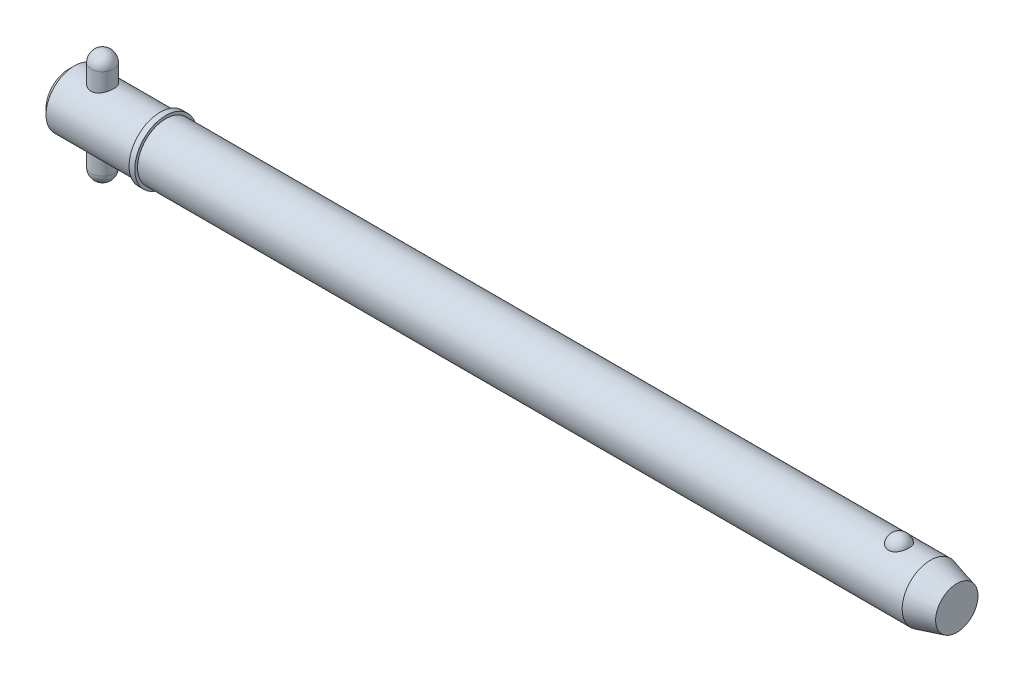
ISO-10303-21;
HEADER;
FILE_DESCRIPTION(('STEP AP214'),'2;1');
FILE_NAME('part.step','',(''),(''),'','','');
FILE_SCHEMA(('AUTOMOTIVE_DESIGN { 1 0 10303 214 1 1 1 1 }'));
ENDSEC;
DATA;
#1=APPLICATION_CONTEXT('core data for automotive mechanical design processes');
#2=APPLICATION_PROTOCOL_DEFINITION('international standard','automotive_design',2000,#1);
#3=PRODUCT_CONTEXT('',#1,'mechanical');
#4=PRODUCT('Part','Part','',(#3));
#5=PRODUCT_RELATED_PRODUCT_CATEGORY('part','',(#4));
#6=PRODUCT_DEFINITION_FORMATION('','',#4);
#7=PRODUCT_DEFINITION_CONTEXT('part definition',#1,'design');
#8=PRODUCT_DEFINITION('design','',#6,#7);
#9=PRODUCT_DEFINITION_SHAPE('','',#8);
#10=(LENGTH_UNIT() NAMED_UNIT(*) SI_UNIT(.MILLI.,.METRE.));
#11=(NAMED_UNIT(*) PLANE_ANGLE_UNIT() SI_UNIT($,.RADIAN.));
#12=(NAMED_UNIT(*) SI_UNIT($,.STERADIAN.) SOLID_ANGLE_UNIT());
#13=UNCERTAINTY_MEASURE_WITH_UNIT(LENGTH_MEASURE(1.E-05),#10,'distance_accuracy_value','');
#14=(GEOMETRIC_REPRESENTATION_CONTEXT(3) GLOBAL_UNCERTAINTY_ASSIGNED_CONTEXT((#13)) GLOBAL_UNIT_ASSIGNED_CONTEXT((#10,
#11,#12)) REPRESENTATION_CONTEXT('',''));
#15=CARTESIAN_POINT('',(0.,0.,0.));
#16=DIRECTION('',(0.,0.,1.));
#17=DIRECTION('',(1.,0.,0.));
#18=AXIS2_PLACEMENT_3D('',#15,#16,#17);
#19=CARTESIAN_POINT('',(9.525,15.875,0.));
#20=DIRECTION('',(0.,-1.,0.));
#21=DIRECTION('',(0.,0.,-1.));
#22=AXIS2_PLACEMENT_3D('',#19,#20,#21);
#23=CYLINDRICAL_SURFACE('',#22,3.175);
#24=CARTESIAN_POINT('',(9.525,-12.7,0.));
#25=DIRECTION('',(0.,-1.,0.));
#26=DIRECTION('',(0.,0.,-1.));
#27=AXIS2_PLACEMENT_3D('',#24,#25,#26);
#28=CIRCLE('',#27,3.175);
#29=CARTESIAN_POINT('',(9.525,-12.7,-3.175));
#30=VERTEX_POINT('',#29);
#31=EDGE_CURVE('P0_E10',#30,#30,#28,.F.);
#32=ORIENTED_EDGE('',*,*,#31,.T.);
#33=EDGE_LOOP('',(#32));
#34=FACE_BOUND('',#33,.T.);
#35=CARTESIAN_POINT('',(9.525,12.7,0.));
#36=DIRECTION('',(0.,-1.,0.));
#37=DIRECTION('',(0.,0.,-1.));
#38=AXIS2_PLACEMENT_3D('',#35,#36,#37);
#39=CIRCLE('',#38,3.175);
#40=CARTESIAN_POINT('',(9.525,12.7,-3.175));
#41=VERTEX_POINT('',#40);
#42=EDGE_CURVE('P0_E21',#41,#41,#39,.T.);
#43=ORIENTED_EDGE('',*,*,#42,.T.);
#44=EDGE_LOOP('',(#43));
#45=FACE_BOUND('',#44,.T.);
#46=ADVANCED_FACE('P0_F14',(#34,#45),#23,.T.);
#47=CARTESIAN_POINT('',(9.525,-12.7,0.));
#48=DIRECTION('',(0.,0.,1.));
#49=DIRECTION('',(1.,0.,0.));
#50=AXIS2_PLACEMENT_3D('',#47,#48,#49);
#51=SPHERICAL_SURFACE('',#50,3.175);
#52=CARTESIAN_POINT('',(9.525,-12.7,0.));
#53=DIRECTION('',(0.,-1.,0.));
#54=DIRECTION('',(0.,0.,-1.));
#55=AXIS2_PLACEMENT_3D('',#52,#53,#54);
#56=SPHERICAL_SURFACE('',#55,3.175);
#57=ORIENTED_EDGE('',*,*,#31,.F.);
#58=EDGE_LOOP('',(#57));
#59=FACE_BOUND('',#58,.T.);
#60=ADVANCED_FACE('P0_F29',(#59),#56,.T.);
#61=CARTESIAN_POINT('',(9.525,12.7,0.));
#62=DIRECTION('',(0.,0.,1.));
#63=DIRECTION('',(1.,0.,0.));
#64=AXIS2_PLACEMENT_3D('',#61,#62,#63);
#65=SPHERICAL_SURFACE('',#64,3.175);
#66=CARTESIAN_POINT('',(9.525,12.7,0.));
#67=DIRECTION('',(0.,-1.,0.));
#68=DIRECTION('',(0.,0.,-1.));
#69=AXIS2_PLACEMENT_3D('',#66,#67,#68);
#70=SPHERICAL_SURFACE('',#69,3.175);
#71=ORIENTED_EDGE('',*,*,#42,.F.);
#72=EDGE_LOOP('',(#71));
#73=FACE_BOUND('',#72,.T.);
#74=ADVANCED_FACE('P0_F16',(#73),#70,.T.);
#75=CLOSED_SHELL('',(#46,#60,#74));
#76=MANIFOLD_SOLID_BREP('P0_B1',#75);
#77=CARTESIAN_POINT('',(0.,0.,0.));
#78=DIRECTION('',(1.,0.,0.));
#79=DIRECTION('',(0.,0.,-1.));
#80=AXIS2_PLACEMENT_3D('',#77,#78,#79);
#81=CYLINDRICAL_SURFACE('',#80,7.94);
#82=CARTESIAN_POINT('',(242.151879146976,0.,0.));
#83=DIRECTION('',(1.,0.,0.));
#84=DIRECTION('',(0.,0.,-1.));
#85=AXIS2_PLACEMENT_3D('',#82,#83,#84);
#86=CIRCLE('',#85,7.94);
#87=CARTESIAN_POINT('',(242.151879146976,0.,-7.94));
#88=VERTEX_POINT('',#87);
#89=EDGE_CURVE('P1_E81',#88,#88,#86,.T.);
#90=ORIENTED_EDGE('',*,*,#89,.F.);
#91=EDGE_LOOP('',(#90));
#92=FACE_BOUND('',#91,.T.);
#93=CARTESIAN_POINT('',(27.31,0.,0.));
#94=DIRECTION('',(1.,0.,0.));
#95=DIRECTION('',(0.,0.,-1.));
#96=AXIS2_PLACEMENT_3D('',#93,#94,#95);
#97=CIRCLE('',#96,7.94);
#98=CARTESIAN_POINT('',(27.31,0.,-7.94));
#99=VERTEX_POINT('',#98);
#100=EDGE_CURVE('P1_E85',#99,#99,#97,.T.);
#101=ORIENTED_EDGE('',*,*,#100,.T.);
#102=EDGE_LOOP('',(#101));
#103=FACE_BOUND('',#102,.T.);
#104=CARTESIAN_POINT('',(233.344907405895,7.37767842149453,2.93486986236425));
#105=CARTESIAN_POINT('',(233.192749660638,7.37767329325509,2.93487505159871));
#106=CARTESIAN_POINT('',(233.040632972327,7.38258419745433,2.92262454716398));
#107=CARTESIAN_POINT('',(232.740928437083,7.40163229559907,2.87404196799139));
#108=CARTESIAN_POINT('',(232.593339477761,7.41576720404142,2.83771585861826));
#109=CARTESIAN_POINT('',(232.307018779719,7.45161576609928,2.74218769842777));
#110=CARTESIAN_POINT('',(232.168274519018,7.47331841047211,2.68301886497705));
#111=CARTESIAN_POINT('',(231.902882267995,7.52194082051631,2.54350967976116));
#112=CARTESIAN_POINT('',(231.776236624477,7.54886159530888,2.463165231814));
#113=CARTESIAN_POINT('',(231.534534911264,7.60594671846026,2.28090375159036));
#114=CARTESIAN_POINT('',(231.419906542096,7.63618114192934,2.17844211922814));
#115=CARTESIAN_POINT('',(231.208878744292,7.6961404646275,1.956084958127));
#116=CARTESIAN_POINT('',(231.112482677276,7.72586526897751,1.8361862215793));
#117=CARTESIAN_POINT('',(230.935938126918,7.78314821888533,1.5762808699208));
#118=CARTESIAN_POINT('',(230.856707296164,7.81055035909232,1.43561546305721));
#119=CARTESIAN_POINT('',(230.721797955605,7.85879631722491,1.14236334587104));
#120=CARTESIAN_POINT('',(230.666121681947,7.87963951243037,0.989775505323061));
#121=CARTESIAN_POINT('',(230.57881215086,7.91289645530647,0.674619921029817));
#122=CARTESIAN_POINT('',(230.54753090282,7.92518652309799,0.511941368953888));
#123=CARTESIAN_POINT('',(230.510975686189,7.93958930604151,0.183247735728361));
#124=CARTESIAN_POINT('',(230.505701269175,7.94170219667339,0.0172327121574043));
#125=CARTESIAN_POINT('',(230.521231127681,7.93554931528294,-0.312672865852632));
#126=CARTESIAN_POINT('',(230.541925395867,7.92732732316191,-0.476569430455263));
#127=CARTESIAN_POINT('',(230.60878655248,7.90141534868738,-0.7983052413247));
#128=CARTESIAN_POINT('',(230.654953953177,7.88372517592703,-0.956144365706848));
#129=CARTESIAN_POINT('',(230.771898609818,7.84066230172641,-1.26152073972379));
#130=CARTESIAN_POINT('',(230.842704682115,7.81528060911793,-1.40904568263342));
#131=CARTESIAN_POINT('',(231.007478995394,7.75948672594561,-1.68950598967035));
#132=CARTESIAN_POINT('',(231.101448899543,7.72907417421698,-1.82244030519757));
#133=CARTESIAN_POINT('',(231.310839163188,7.66640424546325,-2.07032792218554));
#134=CARTESIAN_POINT('',(231.426315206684,7.63414223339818,-2.1852330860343));
#135=CARTESIAN_POINT('',(231.6759006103,7.57149681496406,-2.39329737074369));
#136=CARTESIAN_POINT('',(231.810008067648,7.54111321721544,-2.48645870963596));
#137=CARTESIAN_POINT('',(232.090111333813,7.48650742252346,-2.64628132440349));
#138=CARTESIAN_POINT('',(232.235760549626,7.46215900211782,-2.71350554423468));
#139=CARTESIAN_POINT('',(232.537425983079,7.42171253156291,-2.82226614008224));
#140=CARTESIAN_POINT('',(232.693438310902,7.40561140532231,-2.86381209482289));
#141=CARTESIAN_POINT('',(233.002970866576,7.38426796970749,-2.91839077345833));
#142=CARTESIAN_POINT('',(233.156222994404,7.37852109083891,-2.93275024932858));
#143=CARTESIAN_POINT('',(233.463070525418,7.37700973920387,-2.93655208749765));
#144=CARTESIAN_POINT('',(233.616665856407,7.38124333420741,-2.925999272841));
#145=CARTESIAN_POINT('',(233.914990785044,7.39890635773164,-2.88102897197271));
#146=CARTESIAN_POINT('',(234.059848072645,7.41205491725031,-2.84733999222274));
#147=CARTESIAN_POINT('',(234.34164329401,7.44580110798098,-2.75788206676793));
#148=CARTESIAN_POINT('',(234.478580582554,7.46639934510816,-2.70211132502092));
#149=CARTESIAN_POINT('',(234.744061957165,7.51339098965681,-2.56858908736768));
#150=CARTESIAN_POINT('',(234.872354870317,7.5399020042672,-2.49038067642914));
#151=CARTESIAN_POINT('',(235.114244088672,7.59569503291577,-2.31462737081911));
#152=CARTESIAN_POINT('',(235.227837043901,7.62497767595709,-2.21707808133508));
#153=CARTESIAN_POINT('',(235.44322156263,7.68489473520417,-1.99982049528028));
#154=CARTESIAN_POINT('',(235.544148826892,7.7155241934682,-1.8792533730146));
#155=CARTESIAN_POINT('',(235.725186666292,7.77353016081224,-1.62268826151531));
#156=CARTESIAN_POINT('',(235.805293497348,7.80090608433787,-1.48668750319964));
#157=CARTESIAN_POINT('',(235.945361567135,7.85047992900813,-1.19818413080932));
#158=CARTESIAN_POINT('',(236.004587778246,7.87248183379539,-1.04529016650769));
#159=CARTESIAN_POINT('',(236.097982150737,7.90785114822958,-0.731080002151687));
#160=CARTESIAN_POINT('',(236.132149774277,7.92121837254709,-0.569763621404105));
#161=CARTESIAN_POINT('',(236.174795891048,7.93797834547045,-0.242812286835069));
#162=CARTESIAN_POINT('',(236.183204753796,7.94134405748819,-0.0771668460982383));
#163=CARTESIAN_POINT('',(236.173962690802,7.93767937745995,0.253276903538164));
#164=CARTESIAN_POINT('',(236.156312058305,7.93064910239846,0.418075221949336));
#165=CARTESIAN_POINT('',(236.095424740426,7.90695571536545,0.741525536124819));
#166=CARTESIAN_POINT('',(236.052281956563,7.8903279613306,0.900197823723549));
#167=CARTESIAN_POINT('',(235.94135358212,7.84916386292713,1.20759654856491));
#168=CARTESIAN_POINT('',(235.87356656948,7.82462706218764,1.35632241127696));
#169=CARTESIAN_POINT('',(235.714371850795,7.77006699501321,1.64032869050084));
#170=CARTESIAN_POINT('',(235.622861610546,7.74002008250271,1.7755471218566));
#171=CARTESIAN_POINT('',(235.418296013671,7.67774175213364,2.0280064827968));
#172=CARTESIAN_POINT('',(235.305241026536,7.64551037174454,2.14524772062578));
#173=CARTESIAN_POINT('',(235.060831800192,7.58265895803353,2.35778002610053));
#174=CARTESIAN_POINT('',(234.929583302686,7.5520309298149,2.45319004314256));
#175=CARTESIAN_POINT('',(234.651601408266,7.49579792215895,2.61999897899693));
#176=CARTESIAN_POINT('',(234.504867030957,7.47019326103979,2.69139637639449));
#177=CARTESIAN_POINT('',(234.192947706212,7.42622216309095,2.81053241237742));
#178=CARTESIAN_POINT('',(234.027220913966,7.40825002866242,2.85700910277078));
#179=CARTESIAN_POINT('',(233.689279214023,7.38398348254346,2.91916850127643));
#180=CARTESIAN_POINT('',(233.51706702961,7.37768422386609,2.93486399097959));
#181=CARTESIAN_POINT('',(233.344907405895,7.37767842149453,2.93486986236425));
#182=B_SPLINE_CURVE_WITH_KNOTS('',3,(#104,#105,#106,#107,#108,#109,#110,#111,#112,#113,#114,
#115,#116,#117,#118,#119,#120,#121,#122,#123,#124,#125,#126,#127,#128,#129,#130,#131,#132,#133,
#134,#135,#136,#137,#138,#139,#140,#141,#142,#143,#144,#145,#146,#147,#148,#149,#150,#151,#152,
#153,#154,#155,#156,#157,#158,#159,#160,#161,#162,#163,#164,#165,#166,#167,#168,#169,#170,#171,
#172,#173,#174,#175,#176,#177,#178,#179,#180,#181),.UNSPECIFIED.,.T.,.F.,(4,2,2,2,2,2,2,2,2,2,2,
2,2,2,2,2,2,2,2,2,2,2,2,2,2,2,2,2,2,2,2,2,2,2,2,2,2,2,4),(0.,0.455841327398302,
0.911569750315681,1.36663794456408,1.82179423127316,2.28978983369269,2.75787163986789,
3.24685368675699,3.73588214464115,4.23184282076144,4.7277949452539,5.22165321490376,
5.71552141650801,6.20996917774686,6.70445245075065,7.20023431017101,7.69596557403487,
8.1802341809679,8.6643220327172,9.12410697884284,9.58380291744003,10.0296503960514,
10.475534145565,10.9312349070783,11.3870393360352,11.8654416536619,12.3439299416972,
12.8378875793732,13.3318558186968,13.8271581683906,14.3224549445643,14.8159385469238,
15.3094506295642,15.8051323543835,16.3008055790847,16.7937101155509,17.2866458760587,
17.8026240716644,18.3183879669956),.UNSPECIFIED.);
#183=CARTESIAN_POINT('',(233.344907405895,7.37767842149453,2.93486986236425));
#184=VERTEX_POINT('',#183);
#185=EDGE_CURVE('P1_E35',#184,#184,#182,.T.);
#186=ORIENTED_EDGE('',*,*,#185,.T.);
#187=EDGE_LOOP('',(#186));
#188=FACE_BOUND('',#187,.T.);
#189=ADVANCED_FACE('P1_F13',(#92,#103,#188),#81,.T.);
#190=CARTESIAN_POINT('',(0.,0.,0.));
#191=DIRECTION('',(-1.,0.,0.));
#192=DIRECTION('',(0.,0.,1.));
#193=AXIS2_PLACEMENT_3D('',#190,#191,#192);
#194=PLANE('',#193);
#195=CARTESIAN_POINT('',(0.,0.,0.));
#196=DIRECTION('',(1.,0.,0.));
#197=DIRECTION('',(0.,0.,-1.));
#198=AXIS2_PLACEMENT_3D('',#195,#196,#197);
#199=CIRCLE('',#198,6.352);
#200=CARTESIAN_POINT('',(0.,0.,-6.352));
#201=VERTEX_POINT('',#200);
#202=EDGE_CURVE('P1_E9',#201,#201,#199,.T.);
#203=ORIENTED_EDGE('',*,*,#202,.F.);
#204=EDGE_LOOP('',(#203));
#205=FACE_BOUND('',#204,.T.);
#206=ADVANCED_FACE('P1_F15',(#205),#194,.T.);
#207=CARTESIAN_POINT('',(1.58799999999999,0.,0.));
#208=DIRECTION('',(1.,0.,0.));
#209=DIRECTION('',(0.,0.,-1.));
#210=AXIS2_PLACEMENT_3D('',#207,#208,#209);
#211=CONICAL_SURFACE('',#210,7.94,0.78539816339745);
#212=ORIENTED_EDGE('',*,*,#202,.T.);
#213=EDGE_LOOP('',(#212));
#214=FACE_BOUND('',#213,.T.);
#215=CARTESIAN_POINT('',(1.58799999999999,0.,0.));
#216=DIRECTION('',(1.,0.,0.));
#217=DIRECTION('',(0.,0.,-1.));
#218=AXIS2_PLACEMENT_3D('',#215,#216,#217);
#219=CIRCLE('',#218,7.94);
#220=CARTESIAN_POINT('',(1.58799999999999,0.,-7.94));
#221=VERTEX_POINT('',#220);
#222=EDGE_CURVE('P1_E26',#221,#221,#219,.T.);
#223=ORIENTED_EDGE('',*,*,#222,.F.);
#224=EDGE_LOOP('',(#223));
#225=FACE_BOUND('',#224,.T.);
#226=ADVANCED_FACE('P1_F77',(#214,#225),#211,.T.);
#227=CARTESIAN_POINT('',(0.,0.,0.));
#228=DIRECTION('',(1.,0.,0.));
#229=DIRECTION('',(0.,0.,-1.));
#230=AXIS2_PLACEMENT_3D('',#227,#228,#229);
#231=CYLINDRICAL_SURFACE('',#230,7.94);
#232=CARTESIAN_POINT('',(9.525,-7.27756655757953,3.175));
#233=CARTESIAN_POINT('',(9.43992346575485,-7.27756715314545,3.17499935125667));
#234=CARTESIAN_POINT('',(9.35481882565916,-7.27906496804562,3.1715736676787));
#235=CARTESIAN_POINT('',(9.18524505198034,-7.28499816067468,3.15791803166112));
#236=CARTESIAN_POINT('',(9.100776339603,-7.28943533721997,3.14768391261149));
#237=CARTESIAN_POINT('',(8.84895715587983,-7.30698881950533,3.10684226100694));
#238=CARTESIAN_POINT('',(8.6834173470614,-7.32434654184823,3.06609574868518));
#239=CARTESIAN_POINT('',(8.36278910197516,-7.36806950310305,2.95945910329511));
#240=CARTESIAN_POINT('',(8.20766386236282,-7.39440078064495,2.89366366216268));
#241=CARTESIAN_POINT('',(7.91065319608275,-7.45304562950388,2.73907413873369));
#242=CARTESIAN_POINT('',(7.76876488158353,-7.48535789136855,2.65028508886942));
#243=CARTESIAN_POINT('',(7.49411086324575,-7.55439482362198,2.44679888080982));
#244=CARTESIAN_POINT('',(7.36219910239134,-7.59126138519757,2.33099745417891));
#245=CARTESIAN_POINT('',(7.11904234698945,-7.66408045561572,2.07909838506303));
#246=CARTESIAN_POINT('',(7.00780457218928,-7.70003264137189,1.94299368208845));
#247=CARTESIAN_POINT('',(6.80492173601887,-7.76867514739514,1.64775981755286));
#248=CARTESIAN_POINT('',(6.71422139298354,-7.80118112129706,1.48793473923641));
#249=CARTESIAN_POINT('',(6.56135788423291,-7.85754918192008,1.15376269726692));
#250=CARTESIAN_POINT('',(6.49918311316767,-7.88141478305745,0.979421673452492));
#251=CARTESIAN_POINT('',(6.40818142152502,-7.91680873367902,0.630115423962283));
#252=CARTESIAN_POINT('',(6.3778864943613,-7.9288781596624,0.455588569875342));
#253=CARTESIAN_POINT('',(6.34677743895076,-7.94127547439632,0.103539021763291));
#254=CARTESIAN_POINT('',(6.34595232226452,-7.94160773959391,-0.0739825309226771));
#255=CARTESIAN_POINT('',(6.37300128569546,-7.93082261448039,-0.416371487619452));
#256=CARTESIAN_POINT('',(6.39926693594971,-7.92034690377,-0.581389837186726));
#257=CARTESIAN_POINT('',(6.47701615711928,-7.88998770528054,-0.904449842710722));
#258=CARTESIAN_POINT('',(6.52850157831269,-7.87010352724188,-1.06249098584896));
#259=CARTESIAN_POINT('',(6.65586120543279,-7.82249343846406,-1.36995769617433));
#260=CARTESIAN_POINT('',(6.73209124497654,-7.79465387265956,-1.51921754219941));
#261=CARTESIAN_POINT('',(6.90644286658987,-7.73389606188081,-1.80321183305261));
#262=CARTESIAN_POINT('',(7.00457194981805,-7.70097607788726,-1.93794127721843));
#263=CARTESIAN_POINT('',(7.22744086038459,-7.63084889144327,-2.19843606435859));
#264=CARTESIAN_POINT('',(7.35350432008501,-7.59350211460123,-2.3230330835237));
#265=CARTESIAN_POINT('',(7.62488266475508,-7.52039654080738,-2.54979642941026));
#266=CARTESIAN_POINT('',(7.77020381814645,-7.48463826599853,-2.65195542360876));
#267=CARTESIAN_POINT('',(8.08119298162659,-7.41780943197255,-2.83361305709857));
#268=CARTESIAN_POINT('',(8.24731937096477,-7.38689959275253,-2.91239105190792));
#269=CARTESIAN_POINT('',(8.59204539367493,-7.33515216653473,-3.04038913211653));
#270=CARTESIAN_POINT('',(8.77063684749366,-7.31430804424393,-3.08962840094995));
#271=CARTESIAN_POINT('',(9.12356982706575,-7.28663831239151,-3.15431018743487));
#272=CARTESIAN_POINT('',(9.29750494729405,-7.2790344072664,-3.17163284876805));
#273=CARTESIAN_POINT('',(9.64592502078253,-7.27648884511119,-3.17747282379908));
#274=CARTESIAN_POINT('',(9.82040979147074,-7.28154335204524,-3.16599886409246));
#275=CARTESIAN_POINT('',(10.1545374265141,-7.30294638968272,-3.11628310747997));
#276=CARTESIAN_POINT('',(10.3144598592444,-7.31863587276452,-3.0796016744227));
#277=CARTESIAN_POINT('',(10.625774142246,-7.35872371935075,-2.98253618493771));
#278=CARTESIAN_POINT('',(10.7771640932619,-7.38312401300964,-2.92214687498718));
#279=CARTESIAN_POINT('',(11.0739599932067,-7.4390944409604,-2.77664664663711));
#280=CARTESIAN_POINT('',(11.2188745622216,-7.47091513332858,-2.69063278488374));
#281=CARTESIAN_POINT('',(11.4928722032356,-7.53775867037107,-2.49724834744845));
#282=CARTESIAN_POINT('',(11.6219487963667,-7.57278281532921,-2.38986907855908));
#283=CARTESIAN_POINT('',(11.8705091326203,-7.64520845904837,-2.1474449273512));
#284=CARTESIAN_POINT('',(11.9885816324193,-7.68259462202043,-2.01094304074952));
#285=CARTESIAN_POINT('',(12.2003631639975,-7.75309951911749,-1.71917041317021));
#286=CARTESIAN_POINT('',(12.2940712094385,-7.78621808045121,-1.56389891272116));
#287=CARTESIAN_POINT('',(12.4541161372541,-7.84456050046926,-1.23845027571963));
#288=CARTESIAN_POINT('',(12.5204600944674,-7.86978639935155,-1.06827700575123));
#289=CARTESIAN_POINT('',(12.6231407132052,-7.90943635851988,-0.717928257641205));
#290=CARTESIAN_POINT('',(12.6594936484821,-7.92386627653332,-0.537758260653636));
#291=CARTESIAN_POINT('',(12.6992281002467,-7.93967263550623,-0.185201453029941));
#292=CARTESIAN_POINT('',(12.7046050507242,-7.94183891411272,-0.0130732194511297));
#293=CARTESIAN_POINT('',(12.6875036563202,-7.9350072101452,0.329549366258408));
#294=CARTESIAN_POINT('',(12.6650295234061,-7.92601091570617,0.500043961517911));
#295=CARTESIAN_POINT('',(12.5942896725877,-7.89825976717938,0.829196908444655));
#296=CARTESIAN_POINT('',(12.5468364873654,-7.87981280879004,0.988057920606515));
#297=CARTESIAN_POINT('',(12.4283390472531,-7.83513565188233,1.29553461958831));
#298=CARTESIAN_POINT('',(12.3572904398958,-7.8089040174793,1.44414841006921));
#299=CARTESIAN_POINT('',(12.1900822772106,-7.7497911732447,1.73412879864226));
#300=CARTESIAN_POINT('',(12.0929519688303,-7.71666737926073,1.87488510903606));
#301=CARTESIAN_POINT('',(11.8777894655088,-7.64775894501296,2.13869231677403));
#302=CARTESIAN_POINT('',(11.7597486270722,-7.61197320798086,2.26173585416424));
#303=CARTESIAN_POINT('',(11.4974896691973,-7.53902341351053,2.49449755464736));
#304=CARTESIAN_POINT('',(11.3521039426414,-7.50191102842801,2.60292060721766));
#305=CARTESIAN_POINT('',(11.0440201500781,-7.43289551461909,2.79392602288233));
#306=CARTESIAN_POINT('',(10.8813200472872,-7.40099299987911,2.87650534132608));
#307=CARTESIAN_POINT('',(10.558064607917,-7.3489506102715,3.00682739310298));
#308=CARTESIAN_POINT('',(10.398627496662,-7.32801197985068,3.05703164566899));
#309=CARTESIAN_POINT('',(10.0731242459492,-7.29639491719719,3.13175843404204));
#310=CARTESIAN_POINT('',(9.90707793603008,-7.28568789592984,3.15635254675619));
#311=CARTESIAN_POINT('',(9.70441566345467,-7.27968826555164,3.17013149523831));
#312=CARTESIAN_POINT('',(9.66856669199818,-7.27889378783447,3.17195593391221));
#313=CARTESIAN_POINT('',(9.59681348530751,-7.27783278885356,3.17439036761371));
#314=CARTESIAN_POINT('',(9.56090924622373,-7.27756630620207,3.17500027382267));
#315=CARTESIAN_POINT('',(9.525,-7.27756655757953,3.175));
#316=B_SPLINE_CURVE_WITH_KNOTS('',3,(#232,#233,#234,#235,#236,#237,#238,#239,#240,#241,#242,
#243,#244,#245,#246,#247,#248,#249,#250,#251,#252,#253,#254,#255,#256,#257,#258,#259,#260,#261,
#262,#263,#264,#265,#266,#267,#268,#269,#270,#271,#272,#273,#274,#275,#276,#277,#278,#279,#280,
#281,#282,#283,#284,#285,#286,#287,#288,#289,#290,#291,#292,#293,#294,#295,#296,#297,#298,#299,
#300,#301,#302,#303,#304,#305,#306,#307,#308,#309,#310,#311,#312,#313,#314,#315),.UNSPECIFIED.,
.T.,.F.,(4,2,2,2,2,2,2,2,2,2,2,2,2,2,2,2,2,2,2,2,2,2,2,2,2,2,2,2,2,2,2,2,2,2,2,2,2,2,2,2,2,4),
(0.,0.255187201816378,0.510530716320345,1.0218798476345,1.53131482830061,2.04063840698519,
2.57635929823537,3.11226692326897,3.66929090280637,4.22608806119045,4.75594400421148,
5.28560237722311,5.78552836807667,6.28549104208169,6.79298787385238,7.30065880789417,
7.8416422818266,8.38280228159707,8.93923025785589,9.49529647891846,10.0174074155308,
10.5393601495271,11.0316114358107,11.5239718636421,12.0362920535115,12.5488211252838,
13.0991799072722,13.6495609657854,14.1997996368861,14.7497395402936,15.2638187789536,
15.7778202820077,16.2760504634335,16.7743726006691,17.294711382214,17.8152657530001,
18.3680208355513,18.9208410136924,19.4240423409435,19.9258334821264,20.0335354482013,
20.1412452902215),.UNSPECIFIED.);
#317=CARTESIAN_POINT('',(9.525,-7.27756655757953,3.175));
#318=VERTEX_POINT('',#317);
#319=EDGE_CURVE('P1_E17',#318,#318,#316,.T.);
#320=ORIENTED_EDGE('',*,*,#319,.F.);
#321=EDGE_LOOP('',(#320));
#322=FACE_BOUND('',#321,.T.);
#323=CARTESIAN_POINT('',(9.525,7.27756655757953,3.175));
#324=CARTESIAN_POINT('',(9.61007653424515,7.27756715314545,3.17499935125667));
#325=CARTESIAN_POINT('',(9.69518117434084,7.27906496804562,3.1715736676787));
#326=CARTESIAN_POINT('',(9.86475494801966,7.28499816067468,3.15791803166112));
#327=CARTESIAN_POINT('',(9.949223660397,7.28943533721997,3.14768391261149));
#328=CARTESIAN_POINT('',(10.2010428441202,7.30698881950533,3.10684226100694));
#329=CARTESIAN_POINT('',(10.3665826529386,7.32434654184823,3.06609574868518));
#330=CARTESIAN_POINT('',(10.6872108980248,7.36806950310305,2.95945910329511));
#331=CARTESIAN_POINT('',(10.8423361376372,7.39440078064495,2.89366366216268));
#332=CARTESIAN_POINT('',(11.1393468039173,7.45304562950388,2.73907413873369));
#333=CARTESIAN_POINT('',(11.2812351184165,7.48535789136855,2.65028508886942));
#334=CARTESIAN_POINT('',(11.5558891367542,7.55439482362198,2.44679888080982));
#335=CARTESIAN_POINT('',(11.6878008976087,7.59126138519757,2.33099745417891));
#336=CARTESIAN_POINT('',(11.9309576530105,7.66408045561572,2.07909838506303));
#337=CARTESIAN_POINT('',(12.0421954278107,7.70003264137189,1.94299368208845));
#338=CARTESIAN_POINT('',(12.2450782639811,7.76867514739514,1.64775981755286));
#339=CARTESIAN_POINT('',(12.3357786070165,7.80118112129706,1.48793473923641));
#340=CARTESIAN_POINT('',(12.4886421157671,7.85754918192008,1.15376269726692));
#341=CARTESIAN_POINT('',(12.5508168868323,7.88141478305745,0.979421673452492));
#342=CARTESIAN_POINT('',(12.641818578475,7.91680873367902,0.630115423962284));
#343=CARTESIAN_POINT('',(12.6721135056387,7.9288781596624,0.455588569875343));
#344=CARTESIAN_POINT('',(12.7032225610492,7.94127547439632,0.103539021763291));
#345=CARTESIAN_POINT('',(12.7040476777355,7.94160773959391,-0.0739825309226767));
#346=CARTESIAN_POINT('',(12.6769987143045,7.93082261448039,-0.416371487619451));
#347=CARTESIAN_POINT('',(12.6507330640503,7.92034690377,-0.581389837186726));
#348=CARTESIAN_POINT('',(12.5729838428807,7.88998770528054,-0.904449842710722));
#349=CARTESIAN_POINT('',(12.5214984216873,7.87010352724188,-1.06249098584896));
#350=CARTESIAN_POINT('',(12.3941387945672,7.82249343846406,-1.36995769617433));
#351=CARTESIAN_POINT('',(12.3179087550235,7.79465387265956,-1.51921754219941));
#352=CARTESIAN_POINT('',(12.1435571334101,7.73389606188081,-1.80321183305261));
#353=CARTESIAN_POINT('',(12.0454280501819,7.70097607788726,-1.93794127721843));
#354=CARTESIAN_POINT('',(11.8225591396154,7.63084889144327,-2.19843606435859));
#355=CARTESIAN_POINT('',(11.696495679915,7.59350211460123,-2.3230330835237));
#356=CARTESIAN_POINT('',(11.4251173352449,7.52039654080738,-2.54979642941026));
#357=CARTESIAN_POINT('',(11.2797961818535,7.48463826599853,-2.65195542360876));
#358=CARTESIAN_POINT('',(10.9688070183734,7.41780943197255,-2.83361305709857));
#359=CARTESIAN_POINT('',(10.8026806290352,7.38689959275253,-2.91239105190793));
#360=CARTESIAN_POINT('',(10.4579546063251,7.33515216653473,-3.04038913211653));
#361=CARTESIAN_POINT('',(10.2793631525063,7.31430804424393,-3.08962840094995));
#362=CARTESIAN_POINT('',(9.92643017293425,7.28663831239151,-3.15431018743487));
#363=CARTESIAN_POINT('',(9.75249505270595,7.2790344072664,-3.17163284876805));
#364=CARTESIAN_POINT('',(9.40407497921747,7.2764888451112,-3.17747282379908));
#365=CARTESIAN_POINT('',(9.22959020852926,7.28154335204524,-3.16599886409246));
#366=CARTESIAN_POINT('',(8.89546257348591,7.30294638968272,-3.11628310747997));
#367=CARTESIAN_POINT('',(8.73554014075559,7.31863587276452,-3.0796016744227));
#368=CARTESIAN_POINT('',(8.42422585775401,7.35872371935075,-2.98253618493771));
#369=CARTESIAN_POINT('',(8.27283590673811,7.38312401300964,-2.92214687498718));
#370=CARTESIAN_POINT('',(7.97604000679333,7.4390944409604,-2.77664664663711));
#371=CARTESIAN_POINT('',(7.83112543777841,7.47091513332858,-2.69063278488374));
#372=CARTESIAN_POINT('',(7.55712779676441,7.53775867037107,-2.49724834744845));
#373=CARTESIAN_POINT('',(7.42805120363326,7.57278281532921,-2.38986907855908));
#374=CARTESIAN_POINT('',(7.17949086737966,7.64520845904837,-2.1474449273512));
#375=CARTESIAN_POINT('',(7.06141836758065,7.68259462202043,-2.01094304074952));
#376=CARTESIAN_POINT('',(6.8496368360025,7.75309951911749,-1.71917041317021));
#377=CARTESIAN_POINT('',(6.75592879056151,7.78621808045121,-1.56389891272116));
#378=CARTESIAN_POINT('',(6.59588386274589,7.84456050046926,-1.23845027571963));
#379=CARTESIAN_POINT('',(6.52953990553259,7.86978639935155,-1.06827700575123));
#380=CARTESIAN_POINT('',(6.42685928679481,7.90943635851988,-0.717928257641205));
#381=CARTESIAN_POINT('',(6.39050635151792,7.92386627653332,-0.537758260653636));
#382=CARTESIAN_POINT('',(6.35077189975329,7.93967263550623,-0.18520145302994));
#383=CARTESIAN_POINT('',(6.34539494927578,7.94183891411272,-0.0130732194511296));
#384=CARTESIAN_POINT('',(6.36249634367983,7.9350072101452,0.329549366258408));
#385=CARTESIAN_POINT('',(6.38497047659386,7.92601091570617,0.500043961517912));
#386=CARTESIAN_POINT('',(6.45571032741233,7.89825976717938,0.829196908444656));
#387=CARTESIAN_POINT('',(6.50316351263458,7.87981280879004,0.988057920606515));
#388=CARTESIAN_POINT('',(6.62166095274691,7.83513565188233,1.29553461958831));
#389=CARTESIAN_POINT('',(6.69270956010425,7.8089040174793,1.44414841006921));
#390=CARTESIAN_POINT('',(6.85991772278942,7.7497911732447,1.73412879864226));
#391=CARTESIAN_POINT('',(6.95704803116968,7.71666737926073,1.87488510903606));
#392=CARTESIAN_POINT('',(7.17221053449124,7.64775894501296,2.13869231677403));
#393=CARTESIAN_POINT('',(7.29025137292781,7.61197320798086,2.26173585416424));
#394=CARTESIAN_POINT('',(7.55251033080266,7.53902341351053,2.49449755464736));
#395=CARTESIAN_POINT('',(7.69789605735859,7.50191102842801,2.60292060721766));
#396=CARTESIAN_POINT('',(8.00597984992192,7.43289551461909,2.79392602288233));
#397=CARTESIAN_POINT('',(8.16867995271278,7.40099299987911,2.87650534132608));
#398=CARTESIAN_POINT('',(8.49193539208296,7.3489506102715,3.00682739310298));
#399=CARTESIAN_POINT('',(8.65137250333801,7.32801197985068,3.05703164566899));
#400=CARTESIAN_POINT('',(8.97687575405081,7.29639491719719,3.13175843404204));
#401=CARTESIAN_POINT('',(9.14292206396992,7.28568789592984,3.15635254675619));
#402=CARTESIAN_POINT('',(9.34558433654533,7.27968826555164,3.17013149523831));
#403=CARTESIAN_POINT('',(9.38143330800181,7.27889378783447,3.17195593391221));
#404=CARTESIAN_POINT('',(9.45318651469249,7.27783278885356,3.17439036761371));
#405=CARTESIAN_POINT('',(9.48909075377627,7.27756630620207,3.17500027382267));
#406=CARTESIAN_POINT('',(9.525,7.27756655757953,3.175));
#407=B_SPLINE_CURVE_WITH_KNOTS('',3,(#323,#324,#325,#326,#327,#328,#329,#330,#331,#332,#333,
#334,#335,#336,#337,#338,#339,#340,#341,#342,#343,#344,#345,#346,#347,#348,#349,#350,#351,#352,
#353,#354,#355,#356,#357,#358,#359,#360,#361,#362,#363,#364,#365,#366,#367,#368,#369,#370,#371,
#372,#373,#374,#375,#376,#377,#378,#379,#380,#381,#382,#383,#384,#385,#386,#387,#388,#389,#390,
#391,#392,#393,#394,#395,#396,#397,#398,#399,#400,#401,#402,#403,#404,#405,#406),.UNSPECIFIED.,
.T.,.F.,(4,2,2,2,2,2,2,2,2,2,2,2,2,2,2,2,2,2,2,2,2,2,2,2,2,2,2,2,2,2,2,2,2,2,2,2,2,2,2,2,2,4),
(0.,0.255187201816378,0.510530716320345,1.0218798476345,1.53131482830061,2.04063840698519,
2.57635929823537,3.11226692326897,3.66929090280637,4.22608806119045,4.75594400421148,
5.2856023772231,5.78552836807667,6.28549104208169,6.79298787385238,7.30065880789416,
7.8416422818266,8.38280228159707,8.9392302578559,9.49529647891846,10.0174074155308,
10.5393601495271,11.0316114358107,11.5239718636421,12.0362920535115,12.5488211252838,
13.0991799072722,13.6495609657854,14.1997996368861,14.7497395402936,15.2638187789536,
15.7778202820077,16.2760504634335,16.7743726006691,17.294711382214,17.8152657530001,
18.3680208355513,18.9208410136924,19.4240423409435,19.9258334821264,20.0335354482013,
20.1412452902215),.UNSPECIFIED.);
#408=CARTESIAN_POINT('',(9.525,7.27756655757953,3.175));
#409=VERTEX_POINT('',#408);
#410=EDGE_CURVE('P1_E43',#409,#409,#407,.T.);
#411=ORIENTED_EDGE('',*,*,#410,.F.);
#412=EDGE_LOOP('',(#411));
#413=FACE_BOUND('',#412,.T.);
#414=ORIENTED_EDGE('',*,*,#222,.T.);
#415=EDGE_LOOP('',(#414));
#416=FACE_BOUND('',#415,.T.);
#417=CARTESIAN_POINT('',(25.722,0.,0.));
#418=DIRECTION('',(1.,0.,0.));
#419=DIRECTION('',(0.,0.,-1.));
#420=AXIS2_PLACEMENT_3D('',#417,#418,#419);
#421=CIRCLE('',#420,7.94);
#422=CARTESIAN_POINT('',(25.722,0.,-7.94));
#423=VERTEX_POINT('',#422);
#424=EDGE_CURVE('P1_E31',#423,#423,#421,.T.);
#425=ORIENTED_EDGE('',*,*,#424,.F.);
#426=EDGE_LOOP('',(#425));
#427=FACE_BOUND('',#426,.T.);
#428=ADVANCED_FACE('P1_F103',(#322,#413,#416,#427),#231,.T.);
#429=CARTESIAN_POINT('',(25.722,7.94,0.));
#430=DIRECTION('',(-1.,0.,0.));
#431=DIRECTION('',(0.,0.,1.));
#432=AXIS2_PLACEMENT_3D('',#429,#430,#431);
#433=PLANE('',#432);
#434=ORIENTED_EDGE('',*,*,#424,.T.);
#435=EDGE_LOOP('',(#434));
#436=FACE_BOUND('',#435,.T.);
#437=CARTESIAN_POINT('',(25.722,0.,0.));
#438=DIRECTION('',(1.,0.,0.));
#439=DIRECTION('',(0.,0.,-1.));
#440=AXIS2_PLACEMENT_3D('',#437,#438,#439);
#441=CIRCLE('',#440,8.734);
#442=CARTESIAN_POINT('',(25.722,0.,-8.734));
#443=VERTEX_POINT('',#442);
#444=EDGE_CURVE('P1_E91',#443,#443,#441,.T.);
#445=ORIENTED_EDGE('',*,*,#444,.F.);
#446=EDGE_LOOP('',(#445));
#447=FACE_BOUND('',#446,.T.);
#448=ADVANCED_FACE('P1_F100',(#436,#447),#433,.T.);
#449=CARTESIAN_POINT('',(0.,0.,0.));
#450=DIRECTION('',(1.,0.,0.));
#451=DIRECTION('',(0.,0.,-1.));
#452=AXIS2_PLACEMENT_3D('',#449,#450,#451);
#453=CYLINDRICAL_SURFACE('',#452,8.734);
#454=ORIENTED_EDGE('',*,*,#444,.T.);
#455=EDGE_LOOP('',(#454));
#456=FACE_BOUND('',#455,.T.);
#457=CARTESIAN_POINT('',(27.31,0.,0.));
#458=DIRECTION('',(1.,0.,0.));
#459=DIRECTION('',(0.,0.,-1.));
#460=AXIS2_PLACEMENT_3D('',#457,#458,#459);
#461=CIRCLE('',#460,8.734);
#462=CARTESIAN_POINT('',(27.31,0.,-8.734));
#463=VERTEX_POINT('',#462);
#464=EDGE_CURVE('P1_E88',#463,#463,#461,.T.);
#465=ORIENTED_EDGE('',*,*,#464,.F.);
#466=EDGE_LOOP('',(#465));
#467=FACE_BOUND('',#466,.T.);
#468=ADVANCED_FACE('P1_F68',(#456,#467),#453,.T.);
#469=CARTESIAN_POINT('',(27.31,8.734,0.));
#470=DIRECTION('',(1.,0.,0.));
#471=DIRECTION('',(0.,0.,-1.));
#472=AXIS2_PLACEMENT_3D('',#469,#470,#471);
#473=PLANE('',#472);
#474=ORIENTED_EDGE('',*,*,#464,.T.);
#475=EDGE_LOOP('',(#474));
#476=FACE_BOUND('',#475,.T.);
#477=ORIENTED_EDGE('',*,*,#100,.F.);
#478=EDGE_LOOP('',(#477));
#479=FACE_BOUND('',#478,.T.);
#480=ADVANCED_FACE('P1_F62',(#476,#479),#473,.T.);
#481=CARTESIAN_POINT('',(249.56,0.,0.));
#482=DIRECTION('',(-1.,0.,0.));
#483=DIRECTION('',(0.,0.,1.));
#484=AXIS2_PLACEMENT_3D('',#481,#482,#483);
#485=CONICAL_SURFACE('',#484,5.95500000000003,0.26179938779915);
#486=ORIENTED_EDGE('',*,*,#89,.T.);
#487=EDGE_LOOP('',(#486));
#488=FACE_BOUND('',#487,.T.);
#489=CARTESIAN_POINT('',(249.56,0.,0.));
#490=DIRECTION('',(1.,0.,0.));
#491=DIRECTION('',(0.,0.,-1.));
#492=AXIS2_PLACEMENT_3D('',#489,#490,#491);
#493=CIRCLE('',#492,5.95500000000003);
#494=CARTESIAN_POINT('',(249.56,0.,-5.95500000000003));
#495=VERTEX_POINT('',#494);
#496=EDGE_CURVE('P1_E42',#495,#495,#493,.T.);
#497=ORIENTED_EDGE('',*,*,#496,.F.);
#498=EDGE_LOOP('',(#497));
#499=FACE_BOUND('',#498,.T.);
#500=ADVANCED_FACE('P1_F59',(#488,#499),#485,.T.);
#501=CARTESIAN_POINT('',(249.56,5.95500000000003,0.));
#502=DIRECTION('',(1.,0.,0.));
#503=DIRECTION('',(0.,0.,-1.));
#504=AXIS2_PLACEMENT_3D('',#501,#502,#503);
#505=PLANE('',#504);
#506=ORIENTED_EDGE('',*,*,#496,.T.);
#507=EDGE_LOOP('',(#506));
#508=FACE_BOUND('',#507,.T.);
#509=ADVANCED_FACE('P1_F55',(#508),#505,.T.);
#510=CARTESIAN_POINT('',(233.344907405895,7.146,0.));
#511=DIRECTION('',(-1.,0.,0.));
#512=DIRECTION('',(0.,-1.,0.));
#513=AXIS2_PLACEMENT_3D('',#510,#511,#512);
#514=SPHERICAL_SURFACE('',#513,2.94400000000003);
#515=ORIENTED_EDGE('',*,*,#185,.F.);
#516=EDGE_LOOP('',(#515));
#517=FACE_BOUND('',#516,.T.);
#518=ADVANCED_FACE('P1_F50',(#517),#514,.T.);
#519=CARTESIAN_POINT('',(9.525,-8.734,0.));
#520=DIRECTION('',(0.,1.,0.));
#521=DIRECTION('',(0.,0.,1.));
#522=AXIS2_PLACEMENT_3D('',#519,#520,#521);
#523=CYLINDRICAL_SURFACE('',#522,3.175);
#524=ORIENTED_EDGE('',*,*,#319,.T.);
#525=EDGE_LOOP('',(#524));
#526=FACE_BOUND('',#525,.T.);
#527=ORIENTED_EDGE('',*,*,#410,.T.);
#528=EDGE_LOOP('',(#527));
#529=FACE_BOUND('',#528,.T.);
#530=ADVANCED_FACE('P1_F54',(#526,#529),#523,.F.);
#531=CLOSED_SHELL('',(#189,#206,#226,#428,#448,#468,#480,#500,#509,#518,#530));
#532=MANIFOLD_SOLID_BREP('P1_B1',#531);
#533=ADVANCED_BREP_SHAPE_REPRESENTATION('',(#18,#76,#532),#14);
#534=SHAPE_DEFINITION_REPRESENTATION(#9,#533);
ENDSEC;
END-ISO-10303-21;
